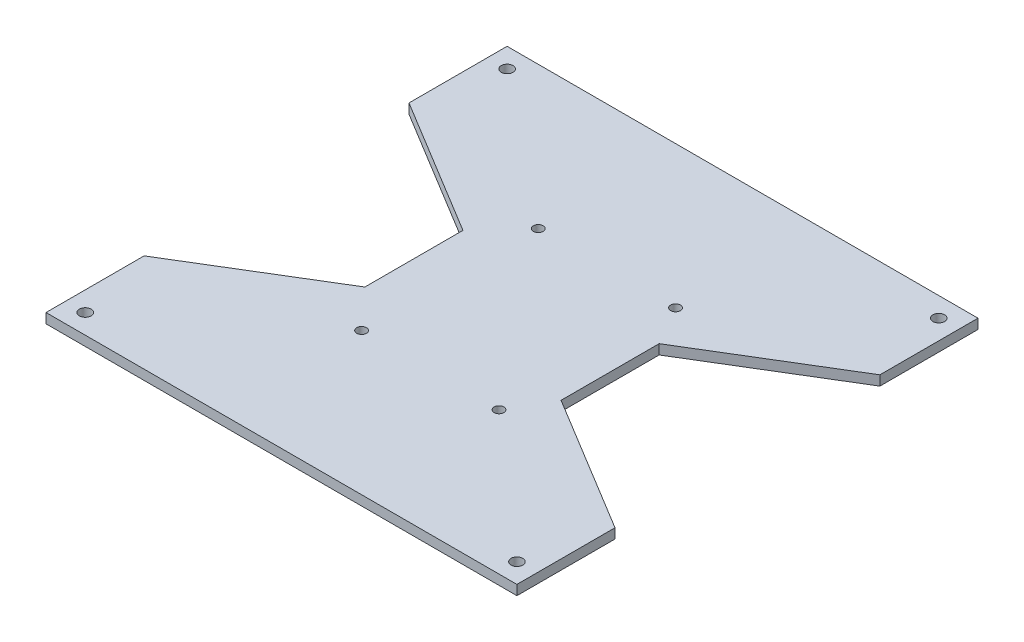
ISO-10303-21;
HEADER;
FILE_DESCRIPTION(('STEP AP214'),'2;1');
FILE_NAME('part.step','',(''),(''),'','','');
FILE_SCHEMA(('AUTOMOTIVE_DESIGN { 1 0 10303 214 1 1 1 1 }'));
ENDSEC;
DATA;
#1=APPLICATION_CONTEXT('core data for automotive mechanical design processes');
#2=APPLICATION_PROTOCOL_DEFINITION('international standard','automotive_design',2000,#1);
#3=PRODUCT_CONTEXT('',#1,'mechanical');
#4=PRODUCT('Part','Part','',(#3));
#5=PRODUCT_RELATED_PRODUCT_CATEGORY('part','',(#4));
#6=PRODUCT_DEFINITION_FORMATION('','',#4);
#7=PRODUCT_DEFINITION_CONTEXT('part definition',#1,'design');
#8=PRODUCT_DEFINITION('design','',#6,#7);
#9=PRODUCT_DEFINITION_SHAPE('','',#8);
#10=(LENGTH_UNIT() NAMED_UNIT(*) SI_UNIT(.MILLI.,.METRE.));
#11=(NAMED_UNIT(*) PLANE_ANGLE_UNIT() SI_UNIT($,.RADIAN.));
#12=(NAMED_UNIT(*) SI_UNIT($,.STERADIAN.) SOLID_ANGLE_UNIT());
#13=UNCERTAINTY_MEASURE_WITH_UNIT(LENGTH_MEASURE(1.E-05),#10,'distance_accuracy_value','');
#14=(GEOMETRIC_REPRESENTATION_CONTEXT(3) GLOBAL_UNCERTAINTY_ASSIGNED_CONTEXT((#13)) GLOBAL_UNIT_ASSIGNED_CONTEXT((#10,
#11,#12)) REPRESENTATION_CONTEXT('',''));
#15=CARTESIAN_POINT('',(0.,0.,0.));
#16=DIRECTION('',(0.,0.,1.));
#17=DIRECTION('',(1.,0.,0.));
#18=AXIS2_PLACEMENT_3D('',#15,#16,#17);
#19=CARTESIAN_POINT('',(0.,0.,0.));
#20=DIRECTION('',(0.,1.,0.));
#21=DIRECTION('',(0.,0.,1.));
#22=AXIS2_PLACEMENT_3D('',#19,#20,#21);
#23=PLANE('',#22);
#24=DIRECTION('',(-0.854787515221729,0.,-0.518978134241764));
#25=VECTOR('',#24,1.);
#26=CARTESIAN_POINT('',(42.9953885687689,0.,-70.8159341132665));
#27=LINE('',#26,#25);
#28=CARTESIAN_POINT('',(160.,0.,0.222579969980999));
#29=VERTEX_POINT('',#28);
#30=CARTESIAN_POINT('',(90.,0.,-42.277420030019));
#31=VERTEX_POINT('',#30);
#32=EDGE_CURVE('E451',#29,#31,#27,.T.);
#33=ORIENTED_EDGE('',*,*,#32,.F.);
#34=DIRECTION('',(0.,0.,-1.));
#35=VECTOR('',#34,1.);
#36=CARTESIAN_POINT('',(160.,0.,0.));
#37=LINE('',#36,#35);
#38=CARTESIAN_POINT('',(160.,0.,50.222579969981));
#39=VERTEX_POINT('',#38);
#40=EDGE_CURVE('E456',#39,#29,#37,.T.);
#41=ORIENTED_EDGE('',*,*,#40,.F.);
#42=DIRECTION('',(-1.,0.,0.));
#43=VECTOR('',#42,1.);
#44=CARTESIAN_POINT('',(0.,0.,50.222579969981));
#45=LINE('',#44,#43);
#46=CARTESIAN_POINT('',(-80.,0.,50.222579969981));
#47=VERTEX_POINT('',#46);
#48=EDGE_CURVE('E458',#39,#47,#45,.T.);
#49=ORIENTED_EDGE('',*,*,#48,.T.);
#50=DIRECTION('',(0.,0.,-1.));
#51=VECTOR('',#50,1.);
#52=CARTESIAN_POINT('',(-80.,0.,0.));
#53=LINE('',#52,#51);
#54=CARTESIAN_POINT('',(-80.,0.,0.22257996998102));
#55=VERTEX_POINT('',#54);
#56=EDGE_CURVE('E463',#47,#55,#53,.T.);
#57=ORIENTED_EDGE('',*,*,#56,.T.);
#58=DIRECTION('',(0.854787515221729,0.,-0.518978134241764));
#59=VECTOR('',#58,1.);
#60=CARTESIAN_POINT('',(-21.4483242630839,0.,-35.3266517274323));
#61=LINE('',#60,#59);
#62=CARTESIAN_POINT('',(-9.99999999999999,0.,-42.277420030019));
#63=VERTEX_POINT('',#62);
#64=EDGE_CURVE('E468',#55,#63,#61,.T.);
#65=ORIENTED_EDGE('',*,*,#64,.T.);
#66=DIRECTION('',(0.,0.,-1.));
#67=VECTOR('',#66,1.);
#68=CARTESIAN_POINT('',(-9.99999999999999,0.,0.));
#69=LINE('',#68,#67);
#70=CARTESIAN_POINT('',(-10.,0.,-92.277420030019));
#71=VERTEX_POINT('',#70);
#72=EDGE_CURVE('E473',#63,#71,#69,.T.);
#73=ORIENTED_EDGE('',*,*,#72,.T.);
#74=DIRECTION('',(-0.854787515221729,0.,-0.518978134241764));
#75=VECTOR('',#74,1.);
#76=CARTESIAN_POINT('',(38.242359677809,0.,-62.9874159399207));
#77=LINE('',#76,#75);
#78=CARTESIAN_POINT('',(-80.,0.,-134.777420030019));
#79=VERTEX_POINT('',#78);
#80=EDGE_CURVE('E478',#71,#79,#77,.T.);
#81=ORIENTED_EDGE('',*,*,#80,.T.);
#82=DIRECTION('',(0.,0.,-1.));
#83=VECTOR('',#82,1.);
#84=CARTESIAN_POINT('',(-80.,0.,0.));
#85=LINE('',#84,#83);
#86=CARTESIAN_POINT('',(-80.,0.,-184.777420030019));
#87=VERTEX_POINT('',#86);
#88=EDGE_CURVE('E483',#79,#87,#85,.T.);
#89=ORIENTED_EDGE('',*,*,#88,.T.);
#90=DIRECTION('',(-1.,0.,0.));
#91=VECTOR('',#90,1.);
#92=CARTESIAN_POINT('',(0.,0.,-184.777420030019));
#93=LINE('',#92,#91);
#94=CARTESIAN_POINT('',(160.,0.,-184.777420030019));
#95=VERTEX_POINT('',#94);
#96=EDGE_CURVE('E489',#95,#87,#93,.T.);
#97=ORIENTED_EDGE('',*,*,#96,.F.);
#98=DIRECTION('',(0.,0.,-1.));
#99=VECTOR('',#98,1.);
#100=CARTESIAN_POINT('',(160.,0.,0.));
#101=LINE('',#100,#99);
#102=CARTESIAN_POINT('',(160.,0.,-134.777420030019));
#103=VERTEX_POINT('',#102);
#104=EDGE_CURVE('E104',#103,#95,#101,.T.);
#105=ORIENTED_EDGE('',*,*,#104,.F.);
#106=DIRECTION('',(0.854787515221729,0.,-0.518978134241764));
#107=VECTOR('',#106,1.);
#108=CARTESIAN_POINT('',(-16.695295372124,0.,-27.4981335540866));
#109=LINE('',#108,#107);
#110=CARTESIAN_POINT('',(90.,0.,-92.277420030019));
#111=VERTEX_POINT('',#110);
#112=EDGE_CURVE('E106',#111,#103,#109,.T.);
#113=ORIENTED_EDGE('',*,*,#112,.F.);
#114=DIRECTION('',(0.,0.,-1.));
#115=VECTOR('',#114,1.);
#116=CARTESIAN_POINT('',(90.,0.,0.));
#117=LINE('',#116,#115);
#118=EDGE_CURVE('E109',#31,#111,#117,.T.);
#119=ORIENTED_EDGE('',*,*,#118,.F.);
#120=EDGE_LOOP('',(#33,#41,#49,#57,#65,#73,#81,#89,#97,#105,#113,#119));
#121=FACE_BOUND('',#120,.T.);
#122=CARTESIAN_POINT('',(-70.0000000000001,0.,40.222579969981));
#123=DIRECTION('',(0.,1.,0.));
#124=DIRECTION('',(0.,0.,1.));
#125=AXIS2_PLACEMENT_3D('',#122,#123,#124);
#126=CIRCLE('',#125,3.00000000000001);
#127=CARTESIAN_POINT('',(-70.0000000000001,0.,43.222579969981));
#128=VERTEX_POINT('',#127);
#129=EDGE_CURVE('E122',#128,#128,#126,.T.);
#130=ORIENTED_EDGE('',*,*,#129,.T.);
#131=EDGE_LOOP('',(#130));
#132=FACE_BOUND('',#131,.T.);
#133=CARTESIAN_POINT('',(-70.,0.,-174.777420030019));
#134=DIRECTION('',(0.,1.,0.));
#135=DIRECTION('',(0.,0.,1.));
#136=AXIS2_PLACEMENT_3D('',#133,#134,#135);
#137=CIRCLE('',#136,3.);
#138=CARTESIAN_POINT('',(-70.,0.,-171.777420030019));
#139=VERTEX_POINT('',#138);
#140=EDGE_CURVE('E160',#139,#139,#137,.T.);
#141=ORIENTED_EDGE('',*,*,#140,.T.);
#142=EDGE_LOOP('',(#141));
#143=FACE_BOUND('',#142,.T.);
#144=CARTESIAN_POINT('',(150.,0.,40.222579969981));
#145=DIRECTION('',(0.,1.,0.));
#146=DIRECTION('',(0.,0.,1.));
#147=AXIS2_PLACEMENT_3D('',#144,#145,#146);
#148=CIRCLE('',#147,3.00000000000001);
#149=CARTESIAN_POINT('',(150.,0.,43.222579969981));
#150=VERTEX_POINT('',#149);
#151=EDGE_CURVE('E163',#150,#150,#148,.T.);
#152=ORIENTED_EDGE('',*,*,#151,.T.);
#153=EDGE_LOOP('',(#152));
#154=FACE_BOUND('',#153,.T.);
#155=CARTESIAN_POINT('',(150.,0.,-174.777420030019));
#156=DIRECTION('',(0.,1.,0.));
#157=DIRECTION('',(0.,0.,1.));
#158=AXIS2_PLACEMENT_3D('',#155,#156,#157);
#159=CIRCLE('',#158,3.);
#160=CARTESIAN_POINT('',(150.,0.,-171.777420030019));
#161=VERTEX_POINT('',#160);
#162=EDGE_CURVE('E166',#161,#161,#159,.T.);
#163=ORIENTED_EDGE('',*,*,#162,.T.);
#164=EDGE_LOOP('',(#163));
#165=FACE_BOUND('',#164,.T.);
#166=CARTESIAN_POINT('',(78.3692395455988,0.,-112.277420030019));
#167=DIRECTION('',(0.,1.,0.));
#168=DIRECTION('',(0.,0.,1.));
#169=AXIS2_PLACEMENT_3D('',#166,#167,#168);
#170=CIRCLE('',#169,2.4999999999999);
#171=CARTESIAN_POINT('',(78.3692395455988,0.,-109.777420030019));
#172=VERTEX_POINT('',#171);
#173=EDGE_CURVE('E169',#172,#172,#170,.T.);
#174=ORIENTED_EDGE('',*,*,#173,.T.);
#175=EDGE_LOOP('',(#174));
#176=FACE_BOUND('',#175,.T.);
#177=CARTESIAN_POINT('',(8.36923954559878,0.,-112.277420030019));
#178=DIRECTION('',(0.,1.,0.));
#179=DIRECTION('',(0.,0.,1.));
#180=AXIS2_PLACEMENT_3D('',#177,#178,#179);
#181=CIRCLE('',#180,2.4999999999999);
#182=CARTESIAN_POINT('',(8.36923954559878,0.,-109.777420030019));
#183=VERTEX_POINT('',#182);
#184=EDGE_CURVE('E172',#183,#183,#181,.T.);
#185=ORIENTED_EDGE('',*,*,#184,.T.);
#186=EDGE_LOOP('',(#185));
#187=FACE_BOUND('',#186,.T.);
#188=CARTESIAN_POINT('',(8.36923954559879,0.,-22.277420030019));
#189=DIRECTION('',(0.,1.,0.));
#190=DIRECTION('',(0.,0.,1.));
#191=AXIS2_PLACEMENT_3D('',#188,#189,#190);
#192=CIRCLE('',#191,2.4999999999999);
#193=CARTESIAN_POINT('',(8.36923954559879,0.,-19.7774200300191));
#194=VERTEX_POINT('',#193);
#195=EDGE_CURVE('E174',#194,#194,#192,.T.);
#196=ORIENTED_EDGE('',*,*,#195,.T.);
#197=EDGE_LOOP('',(#196));
#198=FACE_BOUND('',#197,.T.);
#199=CARTESIAN_POINT('',(78.3692395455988,0.,-22.277420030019));
#200=DIRECTION('',(0.,1.,0.));
#201=DIRECTION('',(0.,0.,1.));
#202=AXIS2_PLACEMENT_3D('',#199,#200,#201);
#203=CIRCLE('',#202,2.4999999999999);
#204=CARTESIAN_POINT('',(78.3692395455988,0.,-19.7774200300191));
#205=VERTEX_POINT('',#204);
#206=EDGE_CURVE('E20',#205,#205,#203,.T.);
#207=ORIENTED_EDGE('',*,*,#206,.T.);
#208=EDGE_LOOP('',(#207));
#209=FACE_BOUND('',#208,.T.);
#210=ADVANCED_FACE('F17',(#121,#132,#143,#154,#165,#176,#187,#198,#209),#23,.F.);
#211=CARTESIAN_POINT('',(78.3692395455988,5.,-22.277420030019));
#212=DIRECTION('',(0.,1.,0.));
#213=DIRECTION('',(0.,0.,1.));
#214=AXIS2_PLACEMENT_3D('',#211,#212,#213);
#215=CYLINDRICAL_SURFACE('',#214,2.4999999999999);
#216=CARTESIAN_POINT('',(78.3692395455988,5.,-22.277420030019));
#217=DIRECTION('',(0.,1.,0.));
#218=DIRECTION('',(0.,0.,1.));
#219=AXIS2_PLACEMENT_3D('',#216,#217,#218);
#220=CIRCLE('',#219,2.4999999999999);
#221=CARTESIAN_POINT('',(78.3692395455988,5.,-19.7774200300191));
#222=VERTEX_POINT('',#221);
#223=EDGE_CURVE('E155',#222,#222,#220,.F.);
#224=ORIENTED_EDGE('',*,*,#223,.F.);
#225=EDGE_LOOP('',(#224));
#226=FACE_BOUND('',#225,.T.);
#227=ORIENTED_EDGE('',*,*,#206,.F.);
#228=EDGE_LOOP('',(#227));
#229=FACE_BOUND('',#228,.T.);
#230=ADVANCED_FACE('F182',(#226,#229),#215,.F.);
#231=CARTESIAN_POINT('',(8.36923954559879,5.,-22.277420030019));
#232=DIRECTION('',(0.,1.,0.));
#233=DIRECTION('',(0.,0.,1.));
#234=AXIS2_PLACEMENT_3D('',#231,#232,#233);
#235=CYLINDRICAL_SURFACE('',#234,2.4999999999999);
#236=CARTESIAN_POINT('',(8.36923954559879,5.,-22.277420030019));
#237=DIRECTION('',(0.,1.,0.));
#238=DIRECTION('',(0.,0.,1.));
#239=AXIS2_PLACEMENT_3D('',#236,#237,#238);
#240=CIRCLE('',#239,2.4999999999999);
#241=CARTESIAN_POINT('',(8.36923954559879,5.,-19.7774200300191));
#242=VERTEX_POINT('',#241);
#243=EDGE_CURVE('E152',#242,#242,#240,.F.);
#244=ORIENTED_EDGE('',*,*,#243,.F.);
#245=EDGE_LOOP('',(#244));
#246=FACE_BOUND('',#245,.T.);
#247=ORIENTED_EDGE('',*,*,#195,.F.);
#248=EDGE_LOOP('',(#247));
#249=FACE_BOUND('',#248,.T.);
#250=ADVANCED_FACE('F184',(#246,#249),#235,.F.);
#251=CARTESIAN_POINT('',(8.36923954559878,5.,-112.277420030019));
#252=DIRECTION('',(0.,1.,0.));
#253=DIRECTION('',(0.,0.,1.));
#254=AXIS2_PLACEMENT_3D('',#251,#252,#253);
#255=CYLINDRICAL_SURFACE('',#254,2.4999999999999);
#256=CARTESIAN_POINT('',(8.36923954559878,5.,-112.277420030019));
#257=DIRECTION('',(0.,1.,0.));
#258=DIRECTION('',(0.,0.,1.));
#259=AXIS2_PLACEMENT_3D('',#256,#257,#258);
#260=CIRCLE('',#259,2.4999999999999);
#261=CARTESIAN_POINT('',(8.36923954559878,5.,-109.777420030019));
#262=VERTEX_POINT('',#261);
#263=EDGE_CURVE('E149',#262,#262,#260,.F.);
#264=ORIENTED_EDGE('',*,*,#263,.F.);
#265=EDGE_LOOP('',(#264));
#266=FACE_BOUND('',#265,.T.);
#267=ORIENTED_EDGE('',*,*,#184,.F.);
#268=EDGE_LOOP('',(#267));
#269=FACE_BOUND('',#268,.T.);
#270=ADVANCED_FACE('F191',(#266,#269),#255,.F.);
#271=CARTESIAN_POINT('',(78.3692395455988,5.,-112.277420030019));
#272=DIRECTION('',(0.,1.,0.));
#273=DIRECTION('',(0.,0.,1.));
#274=AXIS2_PLACEMENT_3D('',#271,#272,#273);
#275=CYLINDRICAL_SURFACE('',#274,2.4999999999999);
#276=CARTESIAN_POINT('',(78.3692395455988,5.,-112.277420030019));
#277=DIRECTION('',(0.,1.,0.));
#278=DIRECTION('',(0.,0.,1.));
#279=AXIS2_PLACEMENT_3D('',#276,#277,#278);
#280=CIRCLE('',#279,2.4999999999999);
#281=CARTESIAN_POINT('',(78.3692395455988,5.,-109.777420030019));
#282=VERTEX_POINT('',#281);
#283=EDGE_CURVE('E146',#282,#282,#280,.F.);
#284=ORIENTED_EDGE('',*,*,#283,.F.);
#285=EDGE_LOOP('',(#284));
#286=FACE_BOUND('',#285,.T.);
#287=ORIENTED_EDGE('',*,*,#173,.F.);
#288=EDGE_LOOP('',(#287));
#289=FACE_BOUND('',#288,.T.);
#290=ADVANCED_FACE('F262',(#286,#289),#275,.F.);
#291=CARTESIAN_POINT('',(150.,-5.,-174.777420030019));
#292=DIRECTION('',(0.,1.,0.));
#293=DIRECTION('',(0.,0.,1.));
#294=AXIS2_PLACEMENT_3D('',#291,#292,#293);
#295=CYLINDRICAL_SURFACE('',#294,3.);
#296=CARTESIAN_POINT('',(150.,5.,-174.777420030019));
#297=DIRECTION('',(0.,1.,0.));
#298=DIRECTION('',(0.,0.,1.));
#299=AXIS2_PLACEMENT_3D('',#296,#297,#298);
#300=CIRCLE('',#299,3.);
#301=CARTESIAN_POINT('',(150.,5.,-171.777420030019));
#302=VERTEX_POINT('',#301);
#303=EDGE_CURVE('E143',#302,#302,#300,.F.);
#304=ORIENTED_EDGE('',*,*,#303,.F.);
#305=EDGE_LOOP('',(#304));
#306=FACE_BOUND('',#305,.T.);
#307=ORIENTED_EDGE('',*,*,#162,.F.);
#308=EDGE_LOOP('',(#307));
#309=FACE_BOUND('',#308,.T.);
#310=ADVANCED_FACE('F258',(#306,#309),#295,.F.);
#311=CARTESIAN_POINT('',(150.,-5.,40.222579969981));
#312=DIRECTION('',(0.,1.,0.));
#313=DIRECTION('',(0.,0.,1.));
#314=AXIS2_PLACEMENT_3D('',#311,#312,#313);
#315=CYLINDRICAL_SURFACE('',#314,3.00000000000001);
#316=CARTESIAN_POINT('',(150.,5.,40.222579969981));
#317=DIRECTION('',(0.,1.,0.));
#318=DIRECTION('',(0.,0.,1.));
#319=AXIS2_PLACEMENT_3D('',#316,#317,#318);
#320=CIRCLE('',#319,3.00000000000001);
#321=CARTESIAN_POINT('',(150.,5.,43.222579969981));
#322=VERTEX_POINT('',#321);
#323=EDGE_CURVE('E140',#322,#322,#320,.F.);
#324=ORIENTED_EDGE('',*,*,#323,.F.);
#325=EDGE_LOOP('',(#324));
#326=FACE_BOUND('',#325,.T.);
#327=ORIENTED_EDGE('',*,*,#151,.F.);
#328=EDGE_LOOP('',(#327));
#329=FACE_BOUND('',#328,.T.);
#330=ADVANCED_FACE('F254',(#326,#329),#315,.F.);
#331=CARTESIAN_POINT('',(-70.,-5.,-174.777420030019));
#332=DIRECTION('',(0.,1.,0.));
#333=DIRECTION('',(0.,0.,1.));
#334=AXIS2_PLACEMENT_3D('',#331,#332,#333);
#335=CYLINDRICAL_SURFACE('',#334,3.);
#336=CARTESIAN_POINT('',(-70.,5.,-174.777420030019));
#337=DIRECTION('',(0.,1.,0.));
#338=DIRECTION('',(0.,0.,1.));
#339=AXIS2_PLACEMENT_3D('',#336,#337,#338);
#340=CIRCLE('',#339,3.);
#341=CARTESIAN_POINT('',(-70.,5.,-171.777420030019));
#342=VERTEX_POINT('',#341);
#343=EDGE_CURVE('E137',#342,#342,#340,.F.);
#344=ORIENTED_EDGE('',*,*,#343,.F.);
#345=EDGE_LOOP('',(#344));
#346=FACE_BOUND('',#345,.T.);
#347=ORIENTED_EDGE('',*,*,#140,.F.);
#348=EDGE_LOOP('',(#347));
#349=FACE_BOUND('',#348,.T.);
#350=ADVANCED_FACE('F250',(#346,#349),#335,.F.);
#351=CARTESIAN_POINT('',(-70.0000000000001,-5.,40.222579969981));
#352=DIRECTION('',(0.,1.,0.));
#353=DIRECTION('',(0.,0.,1.));
#354=AXIS2_PLACEMENT_3D('',#351,#352,#353);
#355=CYLINDRICAL_SURFACE('',#354,3.00000000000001);
#356=CARTESIAN_POINT('',(-70.0000000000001,5.,40.222579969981));
#357=DIRECTION('',(0.,1.,0.));
#358=DIRECTION('',(0.,0.,1.));
#359=AXIS2_PLACEMENT_3D('',#356,#357,#358);
#360=CIRCLE('',#359,3.00000000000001);
#361=CARTESIAN_POINT('',(-70.0000000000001,5.,43.222579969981));
#362=VERTEX_POINT('',#361);
#363=EDGE_CURVE('E133',#362,#362,#360,.F.);
#364=ORIENTED_EDGE('',*,*,#363,.F.);
#365=EDGE_LOOP('',(#364));
#366=FACE_BOUND('',#365,.T.);
#367=ORIENTED_EDGE('',*,*,#129,.F.);
#368=EDGE_LOOP('',(#367));
#369=FACE_BOUND('',#368,.T.);
#370=ADVANCED_FACE('F247',(#366,#369),#355,.F.);
#371=CARTESIAN_POINT('',(90.,5.,0.));
#372=DIRECTION('',(1.,0.,0.));
#373=DIRECTION('',(0.,0.,-1.));
#374=AXIS2_PLACEMENT_3D('',#371,#372,#373);
#375=PLANE('',#374);
#376=DIRECTION('',(0.,0.,1.));
#377=VECTOR('',#376,1.);
#378=CARTESIAN_POINT('',(90.,5.,0.));
#379=LINE('',#378,#377);
#380=CARTESIAN_POINT('',(90.,5.,-42.277420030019));
#381=VERTEX_POINT('',#380);
#382=CARTESIAN_POINT('',(90.,5.,-92.277420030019));
#383=VERTEX_POINT('',#382);
#384=EDGE_CURVE('E136',#381,#383,#379,.F.);
#385=ORIENTED_EDGE('',*,*,#384,.F.);
#386=DIRECTION('',(0.,1.,0.));
#387=VECTOR('',#386,1.);
#388=CARTESIAN_POINT('',(90.,5.,-42.277420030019));
#389=LINE('',#388,#387);
#390=EDGE_CURVE('E120',#31,#381,#389,.T.);
#391=ORIENTED_EDGE('',*,*,#390,.F.);
#392=ORIENTED_EDGE('',*,*,#118,.T.);
#393=DIRECTION('',(0.,1.,0.));
#394=VECTOR('',#393,1.);
#395=CARTESIAN_POINT('',(90.,5.,-92.277420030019));
#396=LINE('',#395,#394);
#397=EDGE_CURVE('E114',#383,#111,#396,.F.);
#398=ORIENTED_EDGE('',*,*,#397,.F.);
#399=EDGE_LOOP('',(#385,#391,#392,#398));
#400=FACE_BOUND('',#399,.T.);
#401=ADVANCED_FACE('F117',(#400),#375,.T.);
#402=CARTESIAN_POINT('',(-16.695295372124,5.,-27.4981335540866));
#403=DIRECTION('',(0.518978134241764,0.,0.854787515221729));
#404=DIRECTION('',(0.854787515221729,0.,-0.518978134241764));
#405=AXIS2_PLACEMENT_3D('',#402,#403,#404);
#406=PLANE('',#405);
#407=DIRECTION('',(0.854787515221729,0.,-0.518978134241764));
#408=VECTOR('',#407,1.);
#409=CARTESIAN_POINT('',(90.,5.,-92.277420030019));
#410=LINE('',#409,#408);
#411=CARTESIAN_POINT('',(160.,5.,-134.777420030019));
#412=VERTEX_POINT('',#411);
#413=EDGE_CURVE('E126',#383,#412,#410,.T.);
#414=ORIENTED_EDGE('',*,*,#413,.F.);
#415=ORIENTED_EDGE('',*,*,#397,.T.);
#416=ORIENTED_EDGE('',*,*,#112,.T.);
#417=DIRECTION('',(0.,1.,0.));
#418=VECTOR('',#417,1.);
#419=CARTESIAN_POINT('',(160.,5.,-134.777420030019));
#420=LINE('',#419,#418);
#421=EDGE_CURVE('E129',#412,#103,#420,.F.);
#422=ORIENTED_EDGE('',*,*,#421,.F.);
#423=EDGE_LOOP('',(#414,#415,#416,#422));
#424=FACE_BOUND('',#423,.T.);
#425=ADVANCED_FACE('F124',(#424),#406,.T.);
#426=CARTESIAN_POINT('',(160.,5.,0.));
#427=DIRECTION('',(1.,0.,0.));
#428=DIRECTION('',(0.,0.,-1.));
#429=AXIS2_PLACEMENT_3D('',#426,#427,#428);
#430=PLANE('',#429);
#431=DIRECTION('',(0.,0.,1.));
#432=VECTOR('',#431,1.);
#433=CARTESIAN_POINT('',(160.,5.,0.));
#434=LINE('',#433,#432);
#435=CARTESIAN_POINT('',(160.,5.,-184.777420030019));
#436=VERTEX_POINT('',#435);
#437=EDGE_CURVE('E438',#412,#436,#434,.F.);
#438=ORIENTED_EDGE('',*,*,#437,.F.);
#439=ORIENTED_EDGE('',*,*,#421,.T.);
#440=ORIENTED_EDGE('',*,*,#104,.T.);
#441=DIRECTION('',(0.,1.,0.));
#442=VECTOR('',#441,1.);
#443=CARTESIAN_POINT('',(160.,5.,-184.777420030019));
#444=LINE('',#443,#442);
#445=EDGE_CURVE('E440',#436,#95,#444,.F.);
#446=ORIENTED_EDGE('',*,*,#445,.F.);
#447=EDGE_LOOP('',(#438,#439,#440,#446));
#448=FACE_BOUND('',#447,.T.);
#449=ADVANCED_FACE('F238',(#448),#430,.T.);
#450=CARTESIAN_POINT('',(0.,5.,-184.777420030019));
#451=DIRECTION('',(0.,0.,-1.));
#452=DIRECTION('',(-1.,0.,0.));
#453=AXIS2_PLACEMENT_3D('',#450,#451,#452);
#454=PLANE('',#453);
#455=DIRECTION('',(1.,0.,0.));
#456=VECTOR('',#455,1.);
#457=CARTESIAN_POINT('',(0.,5.,-184.777420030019));
#458=LINE('',#457,#456);
#459=CARTESIAN_POINT('',(-80.,5.,-184.777420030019));
#460=VERTEX_POINT('',#459);
#461=EDGE_CURVE('E443',#436,#460,#458,.F.);
#462=ORIENTED_EDGE('',*,*,#461,.F.);
#463=ORIENTED_EDGE('',*,*,#445,.T.);
#464=ORIENTED_EDGE('',*,*,#96,.T.);
#465=DIRECTION('',(0.,1.,0.));
#466=VECTOR('',#465,1.);
#467=CARTESIAN_POINT('',(-80.,5.,-184.777420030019));
#468=LINE('',#467,#466);
#469=EDGE_CURVE('E486',#87,#460,#468,.T.);
#470=ORIENTED_EDGE('',*,*,#469,.T.);
#471=EDGE_LOOP('',(#462,#463,#464,#470));
#472=FACE_BOUND('',#471,.T.);
#473=ADVANCED_FACE('F234',(#472),#454,.T.);
#474=CARTESIAN_POINT('',(-80.,5.,0.));
#475=DIRECTION('',(1.,0.,0.));
#476=DIRECTION('',(0.,0.,-1.));
#477=AXIS2_PLACEMENT_3D('',#474,#475,#476);
#478=PLANE('',#477);
#479=DIRECTION('',(0.,1.,0.));
#480=VECTOR('',#479,1.);
#481=CARTESIAN_POINT('',(-80.,5.,-134.777420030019));
#482=LINE('',#481,#480);
#483=CARTESIAN_POINT('',(-80.,5.,-134.777420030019));
#484=VERTEX_POINT('',#483);
#485=EDGE_CURVE('E481',#79,#484,#482,.T.);
#486=ORIENTED_EDGE('',*,*,#485,.T.);
#487=DIRECTION('',(0.,0.,1.));
#488=VECTOR('',#487,1.);
#489=CARTESIAN_POINT('',(-80.,5.,0.));
#490=LINE('',#489,#488);
#491=EDGE_CURVE('E494',#460,#484,#490,.T.);
#492=ORIENTED_EDGE('',*,*,#491,.F.);
#493=ORIENTED_EDGE('',*,*,#469,.F.);
#494=ORIENTED_EDGE('',*,*,#88,.F.);
#495=EDGE_LOOP('',(#486,#492,#493,#494));
#496=FACE_BOUND('',#495,.T.);
#497=ADVANCED_FACE('F230',(#496),#478,.F.);
#498=CARTESIAN_POINT('',(38.242359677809,5.,-62.9874159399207));
#499=DIRECTION('',(0.518978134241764,0.,-0.854787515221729));
#500=DIRECTION('',(-0.854787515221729,0.,-0.518978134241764));
#501=AXIS2_PLACEMENT_3D('',#498,#499,#500);
#502=PLANE('',#501);
#503=DIRECTION('',(0.,1.,0.));
#504=VECTOR('',#503,1.);
#505=CARTESIAN_POINT('',(-9.99999999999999,5.,-92.277420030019));
#506=LINE('',#505,#504);
#507=CARTESIAN_POINT('',(-9.99999999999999,5.,-92.277420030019));
#508=VERTEX_POINT('',#507);
#509=EDGE_CURVE('E476',#71,#508,#506,.T.);
#510=ORIENTED_EDGE('',*,*,#509,.T.);
#511=DIRECTION('',(0.854787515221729,0.,0.518978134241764));
#512=VECTOR('',#511,1.);
#513=CARTESIAN_POINT('',(-80.,5.,-134.777420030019));
#514=LINE('',#513,#512);
#515=EDGE_CURVE('E497',#484,#508,#514,.T.);
#516=ORIENTED_EDGE('',*,*,#515,.F.);
#517=ORIENTED_EDGE('',*,*,#485,.F.);
#518=ORIENTED_EDGE('',*,*,#80,.F.);
#519=EDGE_LOOP('',(#510,#516,#517,#518));
#520=FACE_BOUND('',#519,.T.);
#521=ADVANCED_FACE('F226',(#520),#502,.F.);
#522=CARTESIAN_POINT('',(-9.99999999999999,5.,0.));
#523=DIRECTION('',(1.,0.,0.));
#524=DIRECTION('',(0.,0.,-1.));
#525=AXIS2_PLACEMENT_3D('',#522,#523,#524);
#526=PLANE('',#525);
#527=DIRECTION('',(0.,1.,0.));
#528=VECTOR('',#527,1.);
#529=CARTESIAN_POINT('',(-9.99999999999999,5.,-42.277420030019));
#530=LINE('',#529,#528);
#531=CARTESIAN_POINT('',(-9.99999999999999,5.,-42.277420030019));
#532=VERTEX_POINT('',#531);
#533=EDGE_CURVE('E471',#63,#532,#530,.T.);
#534=ORIENTED_EDGE('',*,*,#533,.T.);
#535=DIRECTION('',(0.,0.,1.));
#536=VECTOR('',#535,1.);
#537=CARTESIAN_POINT('',(-9.99999999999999,5.,0.));
#538=LINE('',#537,#536);
#539=EDGE_CURVE('E501',#508,#532,#538,.T.);
#540=ORIENTED_EDGE('',*,*,#539,.F.);
#541=ORIENTED_EDGE('',*,*,#509,.F.);
#542=ORIENTED_EDGE('',*,*,#72,.F.);
#543=EDGE_LOOP('',(#534,#540,#541,#542));
#544=FACE_BOUND('',#543,.T.);
#545=ADVANCED_FACE('F222',(#544),#526,.F.);
#546=CARTESIAN_POINT('',(-21.4483242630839,5.,-35.3266517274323));
#547=DIRECTION('',(0.518978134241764,0.,0.854787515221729));
#548=DIRECTION('',(0.854787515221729,0.,-0.518978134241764));
#549=AXIS2_PLACEMENT_3D('',#546,#547,#548);
#550=PLANE('',#549);
#551=DIRECTION('',(0.,1.,0.));
#552=VECTOR('',#551,1.);
#553=CARTESIAN_POINT('',(-80.,5.,0.222579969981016));
#554=LINE('',#553,#552);
#555=CARTESIAN_POINT('',(-80.,5.,0.222579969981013));
#556=VERTEX_POINT('',#555);
#557=EDGE_CURVE('E466',#55,#556,#554,.T.);
#558=ORIENTED_EDGE('',*,*,#557,.T.);
#559=DIRECTION('',(-0.854787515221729,0.,0.518978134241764));
#560=VECTOR('',#559,1.);
#561=CARTESIAN_POINT('',(-9.99999999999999,5.,-42.277420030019));
#562=LINE('',#561,#560);
#563=EDGE_CURVE('E504',#532,#556,#562,.T.);
#564=ORIENTED_EDGE('',*,*,#563,.F.);
#565=ORIENTED_EDGE('',*,*,#533,.F.);
#566=ORIENTED_EDGE('',*,*,#64,.F.);
#567=EDGE_LOOP('',(#558,#564,#565,#566));
#568=FACE_BOUND('',#567,.T.);
#569=ADVANCED_FACE('F218',(#568),#550,.F.);
#570=CARTESIAN_POINT('',(-80.,5.,0.));
#571=DIRECTION('',(1.,0.,0.));
#572=DIRECTION('',(0.,0.,-1.));
#573=AXIS2_PLACEMENT_3D('',#570,#571,#572);
#574=PLANE('',#573);
#575=DIRECTION('',(0.,1.,0.));
#576=VECTOR('',#575,1.);
#577=CARTESIAN_POINT('',(-80.,5.,50.222579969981));
#578=LINE('',#577,#576);
#579=CARTESIAN_POINT('',(-80.,5.,50.222579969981));
#580=VERTEX_POINT('',#579);
#581=EDGE_CURVE('E461',#47,#580,#578,.T.);
#582=ORIENTED_EDGE('',*,*,#581,.T.);
#583=DIRECTION('',(0.,0.,1.));
#584=VECTOR('',#583,1.);
#585=CARTESIAN_POINT('',(-80.,5.,0.));
#586=LINE('',#585,#584);
#587=EDGE_CURVE('E507',#556,#580,#586,.T.);
#588=ORIENTED_EDGE('',*,*,#587,.F.);
#589=ORIENTED_EDGE('',*,*,#557,.F.);
#590=ORIENTED_EDGE('',*,*,#56,.F.);
#591=EDGE_LOOP('',(#582,#588,#589,#590));
#592=FACE_BOUND('',#591,.T.);
#593=ADVANCED_FACE('F214',(#592),#574,.F.);
#594=CARTESIAN_POINT('',(0.,5.,50.222579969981));
#595=DIRECTION('',(0.,0.,-1.));
#596=DIRECTION('',(-1.,0.,0.));
#597=AXIS2_PLACEMENT_3D('',#594,#595,#596);
#598=PLANE('',#597);
#599=DIRECTION('',(0.,1.,0.));
#600=VECTOR('',#599,1.);
#601=CARTESIAN_POINT('',(160.,5.,50.222579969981));
#602=LINE('',#601,#600);
#603=CARTESIAN_POINT('',(160.,5.,50.222579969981));
#604=VERTEX_POINT('',#603);
#605=EDGE_CURVE('E453',#604,#39,#602,.F.);
#606=ORIENTED_EDGE('',*,*,#605,.F.);
#607=DIRECTION('',(1.,0.,0.));
#608=VECTOR('',#607,1.);
#609=CARTESIAN_POINT('',(0.,5.,50.222579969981));
#610=LINE('',#609,#608);
#611=EDGE_CURVE('E510',#580,#604,#610,.T.);
#612=ORIENTED_EDGE('',*,*,#611,.F.);
#613=ORIENTED_EDGE('',*,*,#581,.F.);
#614=ORIENTED_EDGE('',*,*,#48,.F.);
#615=EDGE_LOOP('',(#606,#612,#613,#614));
#616=FACE_BOUND('',#615,.T.);
#617=ADVANCED_FACE('F211',(#616),#598,.F.);
#618=CARTESIAN_POINT('',(160.,5.,0.));
#619=DIRECTION('',(1.,0.,0.));
#620=DIRECTION('',(0.,0.,-1.));
#621=AXIS2_PLACEMENT_3D('',#618,#619,#620);
#622=PLANE('',#621);
#623=DIRECTION('',(0.,0.,1.));
#624=VECTOR('',#623,1.);
#625=CARTESIAN_POINT('',(160.,5.,0.));
#626=LINE('',#625,#624);
#627=CARTESIAN_POINT('',(160.,5.,0.222579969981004));
#628=VERTEX_POINT('',#627);
#629=EDGE_CURVE('E26',#604,#628,#626,.F.);
#630=ORIENTED_EDGE('',*,*,#629,.F.);
#631=ORIENTED_EDGE('',*,*,#605,.T.);
#632=ORIENTED_EDGE('',*,*,#40,.T.);
#633=DIRECTION('',(0.,1.,0.));
#634=VECTOR('',#633,1.);
#635=CARTESIAN_POINT('',(160.,5.,0.222579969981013));
#636=LINE('',#635,#634);
#637=EDGE_CURVE('E35',#628,#29,#636,.F.);
#638=ORIENTED_EDGE('',*,*,#637,.F.);
#639=EDGE_LOOP('',(#630,#631,#632,#638));
#640=FACE_BOUND('',#639,.T.);
#641=ADVANCED_FACE('F203',(#640),#622,.T.);
#642=CARTESIAN_POINT('',(42.9953885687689,5.,-70.8159341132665));
#643=DIRECTION('',(0.518978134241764,0.,-0.854787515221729));
#644=DIRECTION('',(-0.854787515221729,0.,-0.518978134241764));
#645=AXIS2_PLACEMENT_3D('',#642,#643,#644);
#646=PLANE('',#645);
#647=DIRECTION('',(-0.854787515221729,0.,-0.518978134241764));
#648=VECTOR('',#647,1.);
#649=CARTESIAN_POINT('',(160.,5.,0.222579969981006));
#650=LINE('',#649,#648);
#651=EDGE_CURVE('E11',#628,#381,#650,.T.);
#652=ORIENTED_EDGE('',*,*,#651,.F.);
#653=ORIENTED_EDGE('',*,*,#637,.T.);
#654=ORIENTED_EDGE('',*,*,#32,.T.);
#655=ORIENTED_EDGE('',*,*,#390,.T.);
#656=EDGE_LOOP('',(#652,#653,#654,#655));
#657=FACE_BOUND('',#656,.T.);
#658=ADVANCED_FACE('F197',(#657),#646,.T.);
#659=CARTESIAN_POINT('',(0.,5.,0.));
#660=DIRECTION('',(0.,1.,0.));
#661=DIRECTION('',(0.,0.,1.));
#662=AXIS2_PLACEMENT_3D('',#659,#660,#661);
#663=PLANE('',#662);
#664=ORIENTED_EDGE('',*,*,#629,.T.);
#665=ORIENTED_EDGE('',*,*,#651,.T.);
#666=ORIENTED_EDGE('',*,*,#384,.T.);
#667=ORIENTED_EDGE('',*,*,#413,.T.);
#668=ORIENTED_EDGE('',*,*,#437,.T.);
#669=ORIENTED_EDGE('',*,*,#461,.T.);
#670=ORIENTED_EDGE('',*,*,#491,.T.);
#671=ORIENTED_EDGE('',*,*,#515,.T.);
#672=ORIENTED_EDGE('',*,*,#539,.T.);
#673=ORIENTED_EDGE('',*,*,#563,.T.);
#674=ORIENTED_EDGE('',*,*,#587,.T.);
#675=ORIENTED_EDGE('',*,*,#611,.T.);
#676=EDGE_LOOP('',(#664,#665,#666,#667,#668,#669,#670,#671,#672,#673,#674,#675));
#677=FACE_BOUND('',#676,.T.);
#678=ORIENTED_EDGE('',*,*,#363,.T.);
#679=EDGE_LOOP('',(#678));
#680=FACE_BOUND('',#679,.T.);
#681=ORIENTED_EDGE('',*,*,#343,.T.);
#682=EDGE_LOOP('',(#681));
#683=FACE_BOUND('',#682,.T.);
#684=ORIENTED_EDGE('',*,*,#323,.T.);
#685=EDGE_LOOP('',(#684));
#686=FACE_BOUND('',#685,.T.);
#687=ORIENTED_EDGE('',*,*,#303,.T.);
#688=EDGE_LOOP('',(#687));
#689=FACE_BOUND('',#688,.T.);
#690=ORIENTED_EDGE('',*,*,#283,.T.);
#691=EDGE_LOOP('',(#690));
#692=FACE_BOUND('',#691,.T.);
#693=ORIENTED_EDGE('',*,*,#263,.T.);
#694=EDGE_LOOP('',(#693));
#695=FACE_BOUND('',#694,.T.);
#696=ORIENTED_EDGE('',*,*,#243,.T.);
#697=EDGE_LOOP('',(#696));
#698=FACE_BOUND('',#697,.T.);
#699=ORIENTED_EDGE('',*,*,#223,.T.);
#700=EDGE_LOOP('',(#699));
#701=FACE_BOUND('',#700,.T.);
#702=ADVANCED_FACE('F195',(#677,#680,#683,#686,#689,#692,#695,#698,#701),#663,.T.);
#703=CLOSED_SHELL('',(#210,#230,#250,#270,#290,#310,#330,#350,#370,#401,#425,#449,#473,#497,
#521,#545,#569,#593,#617,#641,#658,#702));
#704=MANIFOLD_SOLID_BREP('B1',#703);
#705=ADVANCED_BREP_SHAPE_REPRESENTATION('',(#18,#704),#14);
#706=SHAPE_DEFINITION_REPRESENTATION(#9,#705);
ENDSEC;
END-ISO-10303-21;
